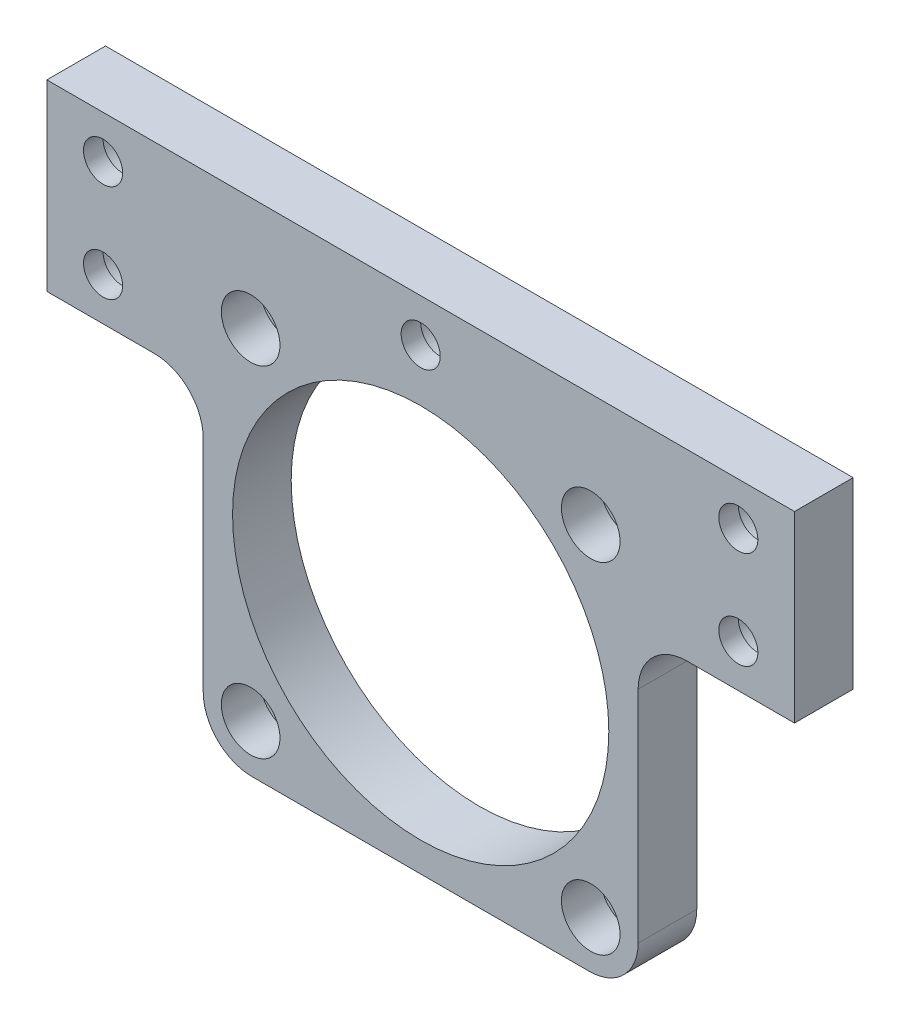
from build123d import *

# Parameters (mm, degrees)
SKETCH1_R           = 38.5
SKETCH1_R_2         = 4.25
BOSS_EXTRUDE1_DEPTH = 12
SKETCH2_R           = 6
CUT_EXTRUDE1_DEPTH  = 8
SKETCH3_R           = 4
CUT_EXTRUDE2_DEPTH  = 12
SKETCH4_R           = 6
CUT_EXTRUDE3_DEPTH  = 8


with BuildPart() as part:
    # Sketch1 → Boss-Extrude1 (new body)
    with BuildSketch(Plane.XY):
        with BuildLine():
            Line((0, 0), (153, 0))
            Line((153, 0), (153, -37.5))
            Line((153, -37.5), (131, -37.5))
            ThreePointArc((131, -37.5), (123.928932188, -40.428932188), (121, -47.5))
            Line((121, -47.5), (121, -92.5))
            ThreePointArc((121, -92.5), (118.071067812, -99.571067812), (111, -102.5))
            Line((111, -102.5), (42, -102.5))
            ThreePointArc((42, -102.5), (34.928932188, -99.571067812), (32, -92.5))
            Line((32, -92.5), (32, -47.5))
            ThreePointArc((32, -47.5), (29.071067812, -40.428932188), (22, -37.5))
            Line((22, -37.5), (0, -37.5))
            Line((0, -37.5), (0, 0))
        make_face()
        with Locations((76.5, -58)):
            Circle(SKETCH1_R, mode=Mode.SUBTRACT)
        with Locations((41.7, -92.8)):
            Circle(SKETCH1_R_2, mode=Mode.SUBTRACT)
        with Locations((111.3, -92.8)):
            Circle(SKETCH1_R_2, mode=Mode.SUBTRACT)
        with Locations((111.3, -23.2)):
            Circle(SKETCH1_R_2, mode=Mode.SUBTRACT)
        with Locations((41.7, -23.2)):
            Circle(SKETCH1_R_2, mode=Mode.SUBTRACT)
    extrude(amount=BOSS_EXTRUDE1_DEPTH)

    # Sketch2 → Cut-Extrude1 (cut)
    with BuildSketch(Plane.XY.offset(12)):
        with Locations((41.7, -23.2)):
            Circle(SKETCH2_R)
        with Locations((111.3, -23.2)):
            Circle(SKETCH2_R)
        with Locations((41.7, -92.8)):
            Circle(SKETCH2_R)
        with Locations((111.3, -92.8)):
            Circle(SKETCH2_R)
    extrude(amount=-CUT_EXTRUDE1_DEPTH, mode=Mode.SUBTRACT)

    # Sketch3 → Cut-Extrude2 (cut)
    with BuildSketch(Plane(origin=(0, 0, 0), x_dir=(-1, 0, 0), z_dir=(0, 0, -1))):
        with Locations((-141.5, -8.75)):
            Circle(SKETCH3_R)
        with Locations((-141.5, -28.75)):
            Circle(SKETCH3_R)
        with Locations((-76.5, -8.75)):
            Circle(SKETCH3_R)
        with Locations((-11.5, -8.75)):
            Circle(SKETCH3_R)
        with Locations((-11.5, -28.75)):
            Circle(SKETCH3_R)
    extrude(amount=-CUT_EXTRUDE2_DEPTH, mode=Mode.SUBTRACT)

    # Sketch4 → Cut-Extrude3 (cut)
    with BuildSketch(Plane(origin=(0, 0, 0), x_dir=(-1, 0, 0), z_dir=(0, 0, -1))):
        with Locations((-141.5, -8.75)):
            Circle(SKETCH4_R)
        with Locations((-141.5, -28.75)):
            Circle(SKETCH4_R)
        with Locations((-76.5, -8.75)):
            Circle(SKETCH4_R)
        with Locations((-11.5, -8.75)):
            Circle(SKETCH4_R)
        with Locations((-11.5, -28.75)):
            Circle(SKETCH4_R)
    extrude(amount=-CUT_EXTRUDE3_DEPTH, mode=Mode.SUBTRACT)


solid = part.part
